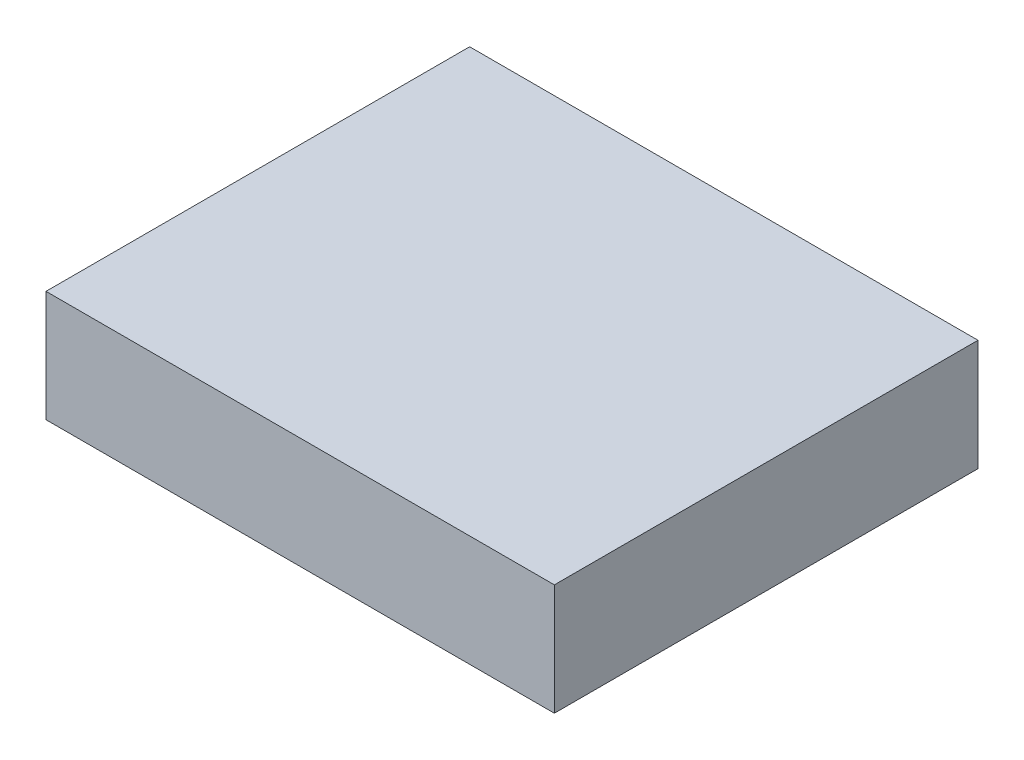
from build123d import *

# Parameters (mm, degrees)
SKETCH1_W           = 4.8
SKETCH1_H           = 4
BOSS_EXTRUDE1_DEPTH = 1.05


with BuildPart() as part:
    # Sketch1 → Boss-Extrude1 (new body)
    with BuildSketch(Plane(origin=(0, 0, 0), x_dir=(1, 0, 0), z_dir=(0, 1, 0))):
        Rectangle(SKETCH1_W, SKETCH1_H)
    extrude(amount=BOSS_EXTRUDE1_DEPTH)


solid = part.part
